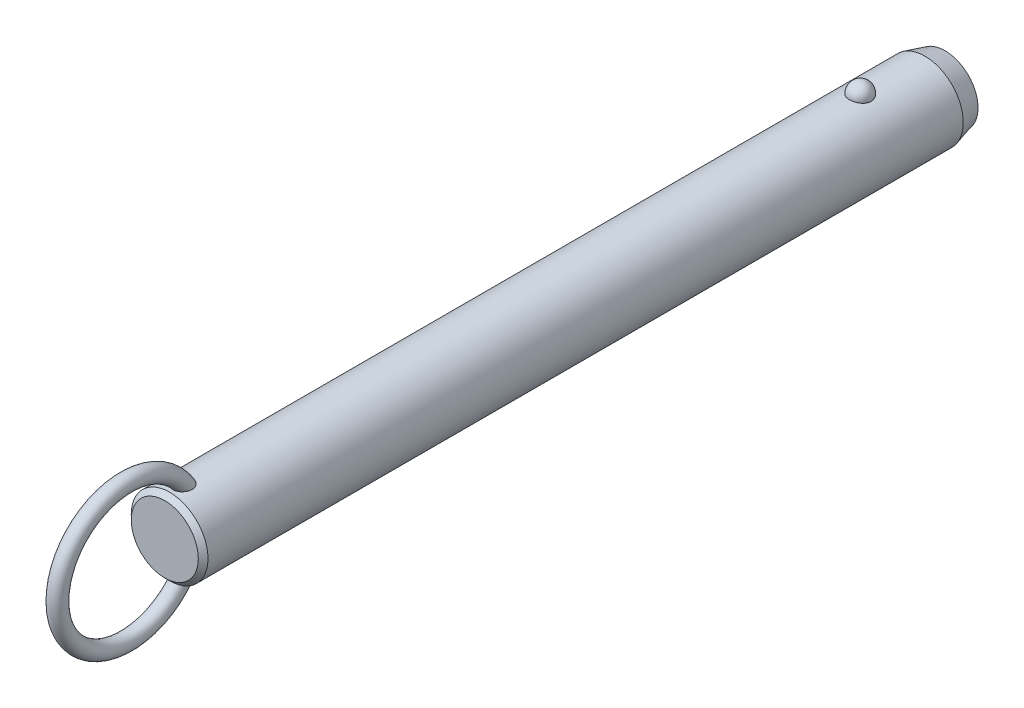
ISO-10303-21;
HEADER;
FILE_DESCRIPTION(('STEP AP214'),'2;1');
FILE_NAME('part.step','',(''),(''),'','','');
FILE_SCHEMA(('AUTOMOTIVE_DESIGN { 1 0 10303 214 1 1 1 1 }'));
ENDSEC;
DATA;
#1=APPLICATION_CONTEXT('core data for automotive mechanical design processes');
#2=APPLICATION_PROTOCOL_DEFINITION('international standard','automotive_design',2000,#1);
#3=PRODUCT_CONTEXT('',#1,'mechanical');
#4=PRODUCT('Part','Part','',(#3));
#5=PRODUCT_RELATED_PRODUCT_CATEGORY('part','',(#4));
#6=PRODUCT_DEFINITION_FORMATION('','',#4);
#7=PRODUCT_DEFINITION_CONTEXT('part definition',#1,'design');
#8=PRODUCT_DEFINITION('design','',#6,#7);
#9=PRODUCT_DEFINITION_SHAPE('','',#8);
#10=(LENGTH_UNIT() NAMED_UNIT(*) SI_UNIT(.MILLI.,.METRE.));
#11=(NAMED_UNIT(*) PLANE_ANGLE_UNIT() SI_UNIT($,.RADIAN.));
#12=(NAMED_UNIT(*) SI_UNIT($,.STERADIAN.) SOLID_ANGLE_UNIT());
#13=UNCERTAINTY_MEASURE_WITH_UNIT(LENGTH_MEASURE(1.E-05),#10,'distance_accuracy_value','');
#14=(GEOMETRIC_REPRESENTATION_CONTEXT(3) GLOBAL_UNCERTAINTY_ASSIGNED_CONTEXT((#13)) GLOBAL_UNIT_ASSIGNED_CONTEXT((#10,
#11,#12)) REPRESENTATION_CONTEXT('',''));
#15=CARTESIAN_POINT('',(0.,0.,0.));
#16=DIRECTION('',(0.,0.,1.));
#17=DIRECTION('',(1.,0.,0.));
#18=AXIS2_PLACEMENT_3D('',#15,#16,#17);
#19=CARTESIAN_POINT('',(0.,0.,160.));
#20=DIRECTION('',(0.,0.,-1.));
#21=DIRECTION('',(-1.,0.,0.));
#22=AXIS2_PLACEMENT_3D('',#19,#20,#21);
#23=CYLINDRICAL_SURFACE('',#22,9.5);
#24=CARTESIAN_POINT('',(2.67259918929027,9.11631578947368,-2.70000000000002));
#25=CARTESIAN_POINT('',(2.6725968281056,9.11631786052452,-2.54909854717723));
#26=CARTESIAN_POINT('',(2.66030567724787,9.11994722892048,-2.39816735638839));
#27=CARTESIAN_POINT('',(2.6114347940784,9.13405924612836,-2.10058568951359));
#28=CARTESIAN_POINT('',(2.57484658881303,9.14454428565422,-1.95393672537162));
#29=CARTESIAN_POINT('',(2.47830875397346,9.17117631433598,-1.66916069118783));
#30=CARTESIAN_POINT('',(2.41836936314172,9.18732082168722,-1.53102991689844));
#31=CARTESIAN_POINT('',(2.27661331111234,9.22346780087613,-1.26705393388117));
#32=CARTESIAN_POINT('',(2.19479699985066,9.24347021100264,-1.14120852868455));
#33=CARTESIAN_POINT('',(2.01085282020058,9.28522401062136,-0.904632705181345));
#34=CARTESIAN_POINT('',(1.90862396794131,9.30698376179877,-0.793982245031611));
#35=CARTESIAN_POINT('',(1.6867437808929,9.34973971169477,-0.59160721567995));
#36=CARTESIAN_POINT('',(1.56709244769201,9.37073591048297,-0.499882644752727));
#37=CARTESIAN_POINT('',(1.31393976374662,9.40956370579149,-0.338167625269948));
#38=CARTESIAN_POINT('',(1.18048026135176,9.42740444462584,-0.268113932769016));
#39=CARTESIAN_POINT('',(0.903154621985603,9.45799906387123,-0.151390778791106));
#40=CARTESIAN_POINT('',(0.759289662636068,9.47075351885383,-0.104718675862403));
#41=CARTESIAN_POINT('',(0.468074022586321,9.48956256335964,-0.0367633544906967));
#42=CARTESIAN_POINT('',(0.320836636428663,9.49573643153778,-0.0150275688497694));
#43=CARTESIAN_POINT('',(0.0246714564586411,9.50112183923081,0.00396199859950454));
#44=CARTESIAN_POINT('',(-0.124256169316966,9.50033406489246,0.00121819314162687));
#45=CARTESIAN_POINT('',(-0.417264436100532,9.4919475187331,-0.0284441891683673));
#46=CARTESIAN_POINT('',(-0.56138413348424,9.48444885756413,-0.0550074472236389));
#47=CARTESIAN_POINT('',(-0.842986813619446,9.46357853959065,-0.131064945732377));
#48=CARTESIAN_POINT('',(-0.980469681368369,9.450206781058,-0.180559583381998));
#49=CARTESIAN_POINT('',(-1.24585005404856,9.41890822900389,-0.301476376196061));
#50=CARTESIAN_POINT('',(-1.37368611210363,9.40095498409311,-0.373026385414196));
#51=CARTESIAN_POINT('',(-1.61552738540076,9.36242964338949,-0.536025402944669));
#52=CARTESIAN_POINT('',(-1.72953116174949,9.34185727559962,-0.627476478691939));
#53=CARTESIAN_POINT('',(-1.9429225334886,9.29984568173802,-0.829844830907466));
#54=CARTESIAN_POINT('',(-2.04198021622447,9.27839736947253,-0.941108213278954));
#55=CARTESIAN_POINT('',(-2.22026460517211,9.23735994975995,-1.17883414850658));
#56=CARTESIAN_POINT('',(-2.29948985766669,9.21777097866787,-1.30529781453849));
#57=CARTESIAN_POINT('',(-2.43697287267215,9.18238994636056,-1.57158566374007));
#58=CARTESIAN_POINT('',(-2.49497068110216,9.16664569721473,-1.71155057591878));
#59=CARTESIAN_POINT('',(-2.5872073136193,9.14104303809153,-1.99961197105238));
#60=CARTESIAN_POINT('',(-2.62144683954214,9.13118445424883,-2.1477082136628));
#61=CARTESIAN_POINT('',(-2.66521466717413,9.11850622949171,-2.44715424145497));
#62=CARTESIAN_POINT('',(-2.67484831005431,9.11565658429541,-2.59848735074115));
#63=CARTESIAN_POINT('',(-2.66946735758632,9.11723375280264,-2.90067317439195));
#64=CARTESIAN_POINT('',(-2.65445345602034,9.12166036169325,-3.05152590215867));
#65=CARTESIAN_POINT('',(-2.60029711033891,9.13724422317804,-3.34766110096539));
#66=CARTESIAN_POINT('',(-2.56127978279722,9.14836656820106,-3.49296833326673));
#67=CARTESIAN_POINT('',(-2.46018844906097,9.17606676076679,-3.77477535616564));
#68=CARTESIAN_POINT('',(-2.39811349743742,9.1926448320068,-3.91127478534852));
#69=CARTESIAN_POINT('',(-2.25202303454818,9.22952198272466,-4.17244273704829));
#70=CARTESIAN_POINT('',(-2.16788714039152,9.24984129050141,-4.29704106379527));
#71=CARTESIAN_POINT('',(-1.9799408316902,9.29188255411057,-4.53013066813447));
#72=CARTESIAN_POINT('',(-1.87612963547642,9.31360456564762,-4.63862130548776));
#73=CARTESIAN_POINT('',(-1.65105429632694,9.35612959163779,-4.83690299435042));
#74=CARTESIAN_POINT('',(-1.52972405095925,9.37692871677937,-4.9266199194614));
#75=CARTESIAN_POINT('',(-1.27318250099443,9.41518970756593,-5.08429106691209));
#76=CARTESIAN_POINT('',(-1.13797219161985,9.432651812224,-5.15224684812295));
#77=CARTESIAN_POINT('',(-0.859280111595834,9.46208255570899,-5.26371827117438));
#78=CARTESIAN_POINT('',(-0.715925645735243,9.47411833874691,-5.30753421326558));
#79=CARTESIAN_POINT('',(-0.423550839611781,9.4916822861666,-5.37076321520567));
#80=CARTESIAN_POINT('',(-0.2745312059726,9.49721125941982,-5.39017930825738));
#81=CARTESIAN_POINT('',(0.0218446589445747,9.50110860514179,-5.40390587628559));
#82=CARTESIAN_POINT('',(0.16917707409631,9.49961381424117,-5.39869609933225));
#83=CARTESIAN_POINT('',(0.460808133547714,9.48993906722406,-5.36441955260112));
#84=CARTESIAN_POINT('',(0.605106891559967,9.48175936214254,-5.33535367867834));
#85=CARTESIAN_POINT('',(0.886027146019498,9.4596376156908,-5.25435587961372));
#86=CARTESIAN_POINT('',(1.02267710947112,9.44571881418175,-5.20251612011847));
#87=CARTESIAN_POINT('',(1.28523827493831,9.41358993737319,-5.07741549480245));
#88=CARTESIAN_POINT('',(1.41114877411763,9.39537958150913,-5.00415322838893));
#89=CARTESIAN_POINT('',(1.65085227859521,9.3562644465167,-4.83684599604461));
#90=CARTESIAN_POINT('',(1.76442346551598,9.33532178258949,-4.74249218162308));
#91=CARTESIAN_POINT('',(1.97425672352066,9.29321198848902,-4.53620389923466));
#92=CARTESIAN_POINT('',(2.07051582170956,9.27204482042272,-4.42426641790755));
#93=CARTESIAN_POINT('',(2.24490086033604,9.23139221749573,-4.18363183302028));
#94=CARTESIAN_POINT('',(2.32267019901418,9.21194380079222,-4.05466990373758));
#95=CARTESIAN_POINT('',(2.45584092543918,9.1773419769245,-3.78517836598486));
#96=CARTESIAN_POINT('',(2.5112497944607,9.16218713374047,-3.644652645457));
#97=CARTESIAN_POINT('',(2.59380876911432,9.13913522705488,-3.37104301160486));
#98=CARTESIAN_POINT('',(2.62330266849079,9.13064624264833,-3.23871053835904));
#99=CARTESIAN_POINT('',(2.66269870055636,9.11923566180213,-2.97092664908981));
#100=CARTESIAN_POINT('',(2.67260130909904,9.11631393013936,-2.83547530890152));
#101=CARTESIAN_POINT('',(2.67259918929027,9.11631578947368,-2.70000000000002));
#102=B_SPLINE_CURVE_WITH_KNOTS('',3,(#24,#25,#26,#27,#28,#29,#30,#31,#32,#33,#34,#35,#36,#37,
#38,#39,#40,#41,#42,#43,#44,#45,#46,#47,#48,#49,#50,#51,#52,#53,#54,#55,#56,#57,#58,#59,#60,#61,
#62,#63,#64,#65,#66,#67,#68,#69,#70,#71,#72,#73,#74,#75,#76,#77,#78,#79,#80,#81,#82,#83,#84,#85,
#86,#87,#88,#89,#90,#91,#92,#93,#94,#95,#96,#97,#98,#99,#100,#101),.UNSPECIFIED.,.T.,.F.,(4,2,2,
2,2,2,2,2,2,2,2,2,2,2,2,2,2,2,2,2,2,2,2,2,2,2,2,2,2,2,2,2,2,2,2,2,2,2,4),(0.,0.452217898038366,
0.904593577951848,1.35677112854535,1.80894144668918,2.26340676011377,2.71787203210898,
3.17099820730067,3.62407318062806,4.0687883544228,4.51345969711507,4.95160616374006,
5.38976021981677,5.83050358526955,6.27129275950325,6.72071308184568,7.17016633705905,
7.62495278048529,8.07972578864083,8.53254856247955,8.98535859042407,9.43582813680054,
9.88631615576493,10.3393155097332,10.7923328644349,11.2471065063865,11.7018475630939,
12.150795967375,12.599688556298,13.0398725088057,13.4800399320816,13.9184421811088,
14.3568730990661,14.802202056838,15.2476074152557,15.7010097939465,16.1542603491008,
16.5602594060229,16.966248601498),.UNSPECIFIED.);
#103=CARTESIAN_POINT('',(2.67259918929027,9.11631578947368,-2.70000000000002));
#104=VERTEX_POINT('',#103);
#105=EDGE_CURVE('E41',#104,#104,#102,.T.);
#106=ORIENTED_EDGE('',*,*,#105,.T.);
#107=EDGE_LOOP('',(#106));
#108=FACE_BOUND('',#107,.T.);
#109=CARTESIAN_POINT('',(0.,0.,168.32));
#110=DIRECTION('',(0.,0.,1.));
#111=DIRECTION('',(1.,0.,0.));
#112=AXIS2_PLACEMENT_3D('',#109,#110,#111);
#113=CIRCLE('',#112,9.5);
#114=CARTESIAN_POINT('',(9.5,0.,168.32));
#115=VERTEX_POINT('',#114);
#116=EDGE_CURVE('E10',#115,#115,#113,.F.);
#117=ORIENTED_EDGE('',*,*,#116,.T.);
#118=EDGE_LOOP('',(#117));
#119=FACE_BOUND('',#118,.T.);
#120=CARTESIAN_POINT('',(-0.697062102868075,-9.47439269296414,162.667808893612));
#121=CARTESIAN_POINT('',(-0.799579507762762,-9.46685146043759,162.707482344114));
#122=CARTESIAN_POINT('',(-0.89857563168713,-9.45788043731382,162.7559309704));
#123=CARTESIAN_POINT('',(-1.08670047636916,-9.43811593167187,162.868868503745));
#124=CARTESIAN_POINT('',(-1.17583204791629,-9.42732297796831,162.933352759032));
#125=CARTESIAN_POINT('',(-1.34179806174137,-9.40513672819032,163.076209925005));
#126=CARTESIAN_POINT('',(-1.41865133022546,-9.39374438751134,163.154561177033));
#127=CARTESIAN_POINT('',(-1.5586004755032,-9.37154196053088,163.322752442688));
#128=CARTESIAN_POINT('',(-1.62169476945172,-9.3607319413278,163.41259377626));
#129=CARTESIAN_POINT('',(-1.73527695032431,-9.34035749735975,163.604500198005));
#130=CARTESIAN_POINT('',(-1.78522266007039,-9.33085270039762,163.706891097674));
#131=CARTESIAN_POINT('',(-1.86924997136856,-9.3143834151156,163.918148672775));
#132=CARTESIAN_POINT('',(-1.90332570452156,-9.30741986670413,164.027017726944));
#133=CARTESIAN_POINT('',(-1.95893603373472,-9.29588482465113,164.260473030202));
#134=CARTESIAN_POINT('',(-1.97872420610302,-9.29165182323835,164.385489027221));
#135=CARTESIAN_POINT('',(-2.00062129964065,-9.28695978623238,164.637080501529));
#136=CARTESIAN_POINT('',(-2.00272284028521,-9.28650232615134,164.763656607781));
#137=CARTESIAN_POINT('',(-1.98958876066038,-9.28932750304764,165.036815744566));
#138=CARTESIAN_POINT('',(-1.97143366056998,-9.2932400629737,165.183251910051));
#139=CARTESIAN_POINT('',(-1.91479925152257,-9.30507151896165,165.472062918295));
#140=CARTESIAN_POINT('',(-1.87629122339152,-9.31299607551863,165.614431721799));
#141=CARTESIAN_POINT('',(-1.7722568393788,-9.33340232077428,165.915172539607));
#142=CARTESIAN_POINT('',(-1.70334898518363,-9.34641636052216,166.072369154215));
#143=CARTESIAN_POINT('',(-1.58111062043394,-9.36759153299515,166.297517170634));
#144=CARTESIAN_POINT('',(-1.5372145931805,-9.37492619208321,166.370796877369));
#145=CARTESIAN_POINT('',(-1.44302631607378,-9.38988566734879,166.51307405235));
#146=CARTESIAN_POINT('',(-1.39273721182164,-9.39751033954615,166.582073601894));
#147=CARTESIAN_POINT('',(-1.26775962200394,-9.41530678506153,166.736983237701));
#148=CARTESIAN_POINT('',(-1.19052326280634,-9.42548108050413,166.820871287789));
#149=CARTESIAN_POINT('',(-1.0242024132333,-9.44499825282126,166.976008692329));
#150=CARTESIAN_POINT('',(-0.935139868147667,-9.45434261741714,167.047280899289));
#151=CARTESIAN_POINT('',(-0.766610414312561,-9.46930670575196,167.158695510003));
#152=CARTESIAN_POINT('',(-0.689439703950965,-9.47529223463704,167.202235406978));
#153=CARTESIAN_POINT('',(-0.52894200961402,-9.48560294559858,167.27631336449));
#154=CARTESIAN_POINT('',(-0.445620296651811,-9.48992953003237,167.306862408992));
#155=CARTESIAN_POINT('',(-0.273901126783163,-9.49644161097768,167.352579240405));
#156=CARTESIAN_POINT('',(-0.18546574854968,-9.49860811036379,167.36761059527));
#157=CARTESIAN_POINT('',(-0.00734541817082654,-9.5004135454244,167.380149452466));
#158=CARTESIAN_POINT('',(0.082338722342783,-9.50005405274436,167.377667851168));
#159=CARTESIAN_POINT('',(0.247679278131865,-9.49708301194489,167.356995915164));
#160=CARTESIAN_POINT('',(0.323620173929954,-9.49477609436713,167.340930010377));
#161=CARTESIAN_POINT('',(0.471981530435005,-9.48855917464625,167.297172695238));
#162=CARTESIAN_POINT('',(0.544400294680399,-9.48464840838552,167.269475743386));
#163=CARTESIAN_POINT('',(0.708947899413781,-9.47398336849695,167.19280266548));
#164=CARTESIAN_POINT('',(0.799149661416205,-9.46671310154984,167.139774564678));
#165=CARTESIAN_POINT('',(0.969783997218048,-9.45076225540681,167.019973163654));
#166=CARTESIAN_POINT('',(1.05019415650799,-9.44207854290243,166.953169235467));
#167=CARTESIAN_POINT('',(1.23092343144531,-9.42051459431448,166.780759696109));
#168=CARTESIAN_POINT('',(1.32652499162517,-9.40733378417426,166.67026193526));
#169=CARTESIAN_POINT('',(1.49893121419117,-9.38140745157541,166.435561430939));
#170=CARTESIAN_POINT('',(1.57571616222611,-9.36866239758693,166.311344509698));
#171=CARTESIAN_POINT('',(1.71285426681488,-9.34457644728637,166.049389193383));
#172=CARTESIAN_POINT('',(1.77266365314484,-9.33328726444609,165.91136233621));
#173=CARTESIAN_POINT('',(1.87239208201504,-9.31379209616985,165.628051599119));
#174=CARTESIAN_POINT('',(1.91230158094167,-9.30558759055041,165.482764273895));
#175=CARTESIAN_POINT('',(1.97604189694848,-9.29228394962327,165.162028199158));
#176=CARTESIAN_POINT('',(1.9958743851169,-9.28797202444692,164.985724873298));
#177=CARTESIAN_POINT('',(2.00295708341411,-9.28645519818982,164.632414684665));
#178=CARTESIAN_POINT('',(1.99025930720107,-9.28923895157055,164.455409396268));
#179=CARTESIAN_POINT('',(1.93735479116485,-9.30038134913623,164.156338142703));
#180=CARTESIAN_POINT('',(1.90576827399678,-9.30697680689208,164.032667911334));
#181=CARTESIAN_POINT('',(1.82287484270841,-9.32356855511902,163.792329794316));
#182=CARTESIAN_POINT('',(1.77158213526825,-9.33356239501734,163.675656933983));
#183=CARTESIAN_POINT('',(1.64885744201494,-9.35602275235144,163.452706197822));
#184=CARTESIAN_POINT('',(1.57730995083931,-9.36850332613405,163.346492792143));
#185=CARTESIAN_POINT('',(1.41543264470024,-9.39431873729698,163.149553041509));
#186=CARTESIAN_POINT('',(1.32510883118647,-9.40765330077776,163.058821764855));
#187=CARTESIAN_POINT('',(1.13846223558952,-9.43195720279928,162.905033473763));
#188=CARTESIAN_POINT('',(1.04369890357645,-9.44302894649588,162.840094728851));
#189=CARTESIAN_POINT('',(0.843965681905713,-9.46296805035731,162.728038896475));
#190=CARTESIAN_POINT('',(0.739000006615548,-9.47183631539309,162.680914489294));
#191=CARTESIAN_POINT('',(0.528175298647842,-9.48586140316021,162.608117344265));
#192=CARTESIAN_POINT('',(0.422686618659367,-9.49119633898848,162.58140249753));
#193=CARTESIAN_POINT('',(0.208590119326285,-9.49831365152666,162.546013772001));
#194=CARTESIAN_POINT('',(0.0999817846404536,-9.500095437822,162.537342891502));
#195=CARTESIAN_POINT('',(-0.126104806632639,-9.49988861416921,162.538350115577));
#196=CARTESIAN_POINT('',(-0.243578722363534,-9.49757821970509,162.549594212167));
#197=CARTESIAN_POINT('',(-0.474390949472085,-9.48885165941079,162.593167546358));
#198=CARTESIAN_POINT('',(-0.587729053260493,-9.48243528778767,162.625497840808));
#199=CARTESIAN_POINT('',(-0.697062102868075,-9.47439269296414,162.667808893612));
#200=B_SPLINE_CURVE_WITH_KNOTS('',3,(#120,#121,#122,#123,#124,#125,#126,#127,#128,#129,#130,
#131,#132,#133,#134,#135,#136,#137,#138,#139,#140,#141,#142,#143,#144,#145,#146,#147,#148,#149,
#150,#151,#152,#153,#154,#155,#156,#157,#158,#159,#160,#161,#162,#163,#164,#165,#166,#167,#168,
#169,#170,#171,#172,#173,#174,#175,#176,#177,#178,#179,#180,#181,#182,#183,#184,#185,#186,#187,
#188,#189,#190,#191,#192,#193,#194,#195,#196,#197,#198,#199),.UNSPECIFIED.,.T.,.F.,(4,2,2,2,2,2,
2,2,2,2,2,2,2,2,2,2,2,2,2,2,2,2,2,2,2,2,2,2,2,2,2,2,2,2,2,2,2,2,2,4),(0.,0.330119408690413,
0.6601431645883,0.98965593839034,1.31920659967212,1.66074728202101,2.00241415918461,
2.38088696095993,2.75951768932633,3.20065679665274,3.64242004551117,4.15620996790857,
4.41314162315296,4.66994734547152,5.01228664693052,5.35399933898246,5.61943037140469,
5.88463652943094,6.15215502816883,6.41950709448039,6.65144391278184,6.88349136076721,
7.19641200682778,7.51003602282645,7.94779711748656,8.3860149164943,8.83699707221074,
9.28819530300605,9.81778662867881,10.34653170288,10.7284172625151,11.1100280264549,
11.4938603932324,11.8775702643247,12.2220189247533,12.5663259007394,12.8915939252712,
13.2169159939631,13.5689650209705,13.9210316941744),.UNSPECIFIED.);
#201=CARTESIAN_POINT('',(-0.697062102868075,-9.47439269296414,162.667808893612));
#202=VERTEX_POINT('',#201);
#203=EDGE_CURVE('E60',#202,#202,#200,.T.);
#204=ORIENTED_EDGE('',*,*,#203,.T.);
#205=EDGE_LOOP('',(#204));
#206=FACE_BOUND('',#205,.T.);
#207=CARTESIAN_POINT('',(-0.697062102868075,9.47439269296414,162.667808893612));
#208=CARTESIAN_POINT('',(-0.597792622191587,9.48169483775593,162.62939564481));
#209=CARTESIAN_POINT('',(-0.495106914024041,9.48766580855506,162.599168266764));
#210=CARTESIAN_POINT('',(-0.285876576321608,9.49627648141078,162.556032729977));
#211=CARTESIAN_POINT('',(-0.179324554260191,9.49890941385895,162.543159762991));
#212=CARTESIAN_POINT('',(0.0344157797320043,9.50053798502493,162.535166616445));
#213=CARTESIAN_POINT('',(0.14160360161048,9.49953613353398,162.540034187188));
#214=CARTESIAN_POINT('',(0.353563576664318,9.49401038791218,162.567365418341));
#215=CARTESIAN_POINT('',(0.458336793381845,9.48948807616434,162.58982117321));
#216=CARTESIAN_POINT('',(0.662493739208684,9.4774236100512,162.651671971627));
#217=CARTESIAN_POINT('',(0.761881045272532,9.46988348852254,162.691055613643));
#218=CARTESIAN_POINT('',(0.952608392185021,9.45260382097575,162.785634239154));
#219=CARTESIAN_POINT('',(1.04394806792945,9.44286417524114,162.840829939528));
#220=CARTESIAN_POINT('',(1.21712767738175,9.42211760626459,162.966066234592));
#221=CARTESIAN_POINT('',(1.29885671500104,9.41109835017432,163.036257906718));
#222=CARTESIAN_POINT('',(1.44978975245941,9.38903310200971,163.188980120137));
#223=CARTESIAN_POINT('',(1.51899278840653,9.37798710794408,163.271511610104));
#224=CARTESIAN_POINT('',(1.64602857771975,9.35654375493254,163.449776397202));
#225=CARTESIAN_POINT('',(1.70333052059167,9.34618688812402,163.545891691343));
#226=CARTESIAN_POINT('',(1.80259341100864,9.32755128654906,163.745897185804));
#227=CARTESIAN_POINT('',(1.84454942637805,9.31927322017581,163.849789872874));
#228=CARTESIAN_POINT('',(1.91637039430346,9.30478365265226,164.072213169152));
#229=CARTESIAN_POINT('',(1.944805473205,9.29882552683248,164.191219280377));
#230=CARTESIAN_POINT('',(1.98449865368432,9.29043398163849,164.432143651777));
#231=CARTESIAN_POINT('',(1.99574908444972,9.28800213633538,164.554063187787));
#232=CARTESIAN_POINT('',(2.00275141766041,9.28649645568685,164.816932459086));
#233=CARTESIAN_POINT('',(1.99588238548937,9.28799035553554,164.957952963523));
#234=CARTESIAN_POINT('',(1.96270559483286,9.29505517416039,165.237621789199));
#235=CARTESIAN_POINT('',(1.93637872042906,9.30063010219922,165.376267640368));
#236=CARTESIAN_POINT('',(1.85949176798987,9.31633564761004,165.672561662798));
#237=CARTESIAN_POINT('',(1.80549792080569,9.3270926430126,165.829290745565));
#238=CARTESIAN_POINT('',(1.67376869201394,9.3516306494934,166.132284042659));
#239=CARTESIAN_POINT('',(1.59603181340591,9.36541185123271,166.278547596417));
#240=CARTESIAN_POINT('',(1.4360277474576,9.39110706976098,166.525813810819));
#241=CARTESIAN_POINT('',(1.35831795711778,9.40278656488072,166.629791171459));
#242=CARTESIAN_POINT('',(1.18774483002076,9.42585025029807,166.824534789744));
#243=CARTESIAN_POINT('',(1.09490932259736,9.43723493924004,166.915324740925));
#244=CARTESIAN_POINT('',(0.921110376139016,9.45552616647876,167.05620334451));
#245=CARTESIAN_POINT('',(0.843738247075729,9.46281058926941,167.110656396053));
#246=CARTESIAN_POINT('',(0.681245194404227,9.47589120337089,167.206711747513));
#247=CARTESIAN_POINT('',(0.596135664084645,9.48168953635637,167.248332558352));
#248=CARTESIAN_POINT('',(0.433779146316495,9.49038144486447,167.310089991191));
#249=CARTESIAN_POINT('',(0.35745955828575,9.49359170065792,167.33260136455));
#250=CARTESIAN_POINT('',(0.202074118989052,9.49816761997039,167.364574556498));
#251=CARTESIAN_POINT('',(0.123010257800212,9.49953459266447,167.374045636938));
#252=CARTESIAN_POINT('',(-0.0357372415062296,9.50026497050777,167.379114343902));
#253=CARTESIAN_POINT('',(-0.115421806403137,9.49962433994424,167.374684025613));
#254=CARTESIAN_POINT('',(-0.272823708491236,9.49640854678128,167.352296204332));
#255=CARTESIAN_POINT('',(-0.350540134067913,9.4938325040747,167.334332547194));
#256=CARTESIAN_POINT('',(-0.500580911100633,9.48709462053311,167.286802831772));
#257=CARTESIAN_POINT('',(-0.572979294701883,9.48296359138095,167.257461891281));
#258=CARTESIAN_POINT('',(-0.712864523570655,9.47347609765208,167.189008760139));
#259=CARTESIAN_POINT('',(-0.780349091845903,9.46811906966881,167.149892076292));
#260=CARTESIAN_POINT('',(-0.946309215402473,9.45329720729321,167.039432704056));
#261=CARTESIAN_POINT('',(-1.04090230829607,9.44321512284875,166.962329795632));
#262=CARTESIAN_POINT('',(-1.21661929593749,9.42219227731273,166.79409718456));
#263=CARTESIAN_POINT('',(-1.29770519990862,9.41124921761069,166.702929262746));
#264=CARTESIAN_POINT('',(-1.47319646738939,9.38563439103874,166.476162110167));
#265=CARTESIAN_POINT('',(-1.5620887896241,9.37102009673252,166.336289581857));
#266=CARTESIAN_POINT('',(-1.71623987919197,9.34401559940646,166.043950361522));
#267=CARTESIAN_POINT('',(-1.7814786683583,9.33162728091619,165.891473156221));
#268=CARTESIAN_POINT('',(-1.88853837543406,9.31055541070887,165.575647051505));
#269=CARTESIAN_POINT('',(-1.92998995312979,9.30193076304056,165.412168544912));
#270=CARTESIAN_POINT('',(-1.98590726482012,9.29015757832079,165.080526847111));
#271=CARTESIAN_POINT('',(-2.0004070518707,9.2870021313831,164.912369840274));
#272=CARTESIAN_POINT('',(-1.99964701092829,9.28716218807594,164.605080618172));
#273=CARTESIAN_POINT('',(-1.98908145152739,9.28945704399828,164.465936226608));
#274=CARTESIAN_POINT('',(-1.94566294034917,9.29865169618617,164.191153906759));
#275=CARTESIAN_POINT('',(-1.91282062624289,9.30554929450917,164.055514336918));
#276=CARTESIAN_POINT('',(-1.84582133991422,9.31898248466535,163.857802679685));
#277=CARTESIAN_POINT('',(-1.82038084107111,9.32400364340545,163.792583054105));
#278=CARTESIAN_POINT('',(-1.7635051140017,9.33492884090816,163.664903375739));
#279=CARTESIAN_POINT('',(-1.73207305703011,9.34083241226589,163.602441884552));
#280=CARTESIAN_POINT('',(-1.66324243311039,9.35333332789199,163.48094078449));
#281=CARTESIAN_POINT('',(-1.625842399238,9.35993084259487,163.421902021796));
#282=CARTESIAN_POINT('',(-1.54527678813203,9.37356864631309,163.307987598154));
#283=CARTESIAN_POINT('',(-1.50211241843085,9.38060884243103,163.253111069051));
#284=CARTESIAN_POINT('',(-1.37681147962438,9.40004442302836,163.109961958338));
#285=CARTESIAN_POINT('',(-1.28916358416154,9.41261047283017,163.026429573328));
#286=CARTESIAN_POINT('',(-1.09996826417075,9.43658180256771,162.877236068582));
#287=CARTESIAN_POINT('',(-0.998461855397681,9.44799034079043,162.811523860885));
#288=CARTESIAN_POINT('',(-0.860188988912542,9.46103017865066,162.7394367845));
#289=CARTESIAN_POINT('',(-0.828141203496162,9.46389141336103,162.723851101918));
#290=CARTESIAN_POINT('',(-0.763210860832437,9.46934915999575,162.694473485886));
#291=CARTESIAN_POINT('',(-0.730328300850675,9.47194567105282,162.680681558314));
#292=CARTESIAN_POINT('',(-0.697062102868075,9.47439269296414,162.667808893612));
#293=B_SPLINE_CURVE_WITH_KNOTS('',3,(#207,#208,#209,#210,#211,#212,#213,#214,#215,#216,#217,
#218,#219,#220,#221,#222,#223,#224,#225,#226,#227,#228,#229,#230,#231,#232,#233,#234,#235,#236,
#237,#238,#239,#240,#241,#242,#243,#244,#245,#246,#247,#248,#249,#250,#251,#252,#253,#254,#255,
#256,#257,#258,#259,#260,#261,#262,#263,#264,#265,#266,#267,#268,#269,#270,#271,#272,#273,#274,
#275,#276,#277,#278,#279,#280,#281,#282,#283,#284,#285,#286,#287,#288,#289,#290,#291,#292),
.UNSPECIFIED.,.T.,.F.,(4,2,2,2,2,2,2,2,2,2,2,2,2,2,2,2,2,2,2,2,2,2,2,2,2,2,2,2,2,2,2,2,2,2,2,2,
2,2,2,2,2,2,4),(0.,0.319942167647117,0.640532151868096,0.960900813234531,1.28112555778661,
1.60113495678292,1.92115886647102,2.24457323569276,2.56801248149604,2.90371927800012,
3.23953387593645,3.60560313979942,3.97183576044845,4.39383693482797,4.81625324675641,
5.31257045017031,5.80891895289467,6.19868344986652,6.58773876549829,6.87145417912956,
7.15475838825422,7.3926375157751,7.63034760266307,7.86853584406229,8.10683246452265,
8.34063661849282,8.57454843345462,8.93983939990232,9.30614105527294,9.80266668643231,
10.2996107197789,10.8040753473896,11.3079021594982,11.7249776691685,12.1418541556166,
12.3521485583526,12.5623319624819,12.7725671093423,12.9827582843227,13.345827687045,
13.7078449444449,13.8150604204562,13.9222762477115),.UNSPECIFIED.);
#294=CARTESIAN_POINT('',(-0.697062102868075,9.47439269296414,162.667808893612));
#295=VERTEX_POINT('',#294);
#296=EDGE_CURVE('E67',#295,#295,#293,.T.);
#297=ORIENTED_EDGE('',*,*,#296,.T.);
#298=EDGE_LOOP('',(#297));
#299=FACE_BOUND('',#298,.T.);
#300=CARTESIAN_POINT('',(0.,0.,-18.6999999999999));
#301=DIRECTION('',(0.,0.,-1.));
#302=DIRECTION('',(-1.,0.,0.));
#303=AXIS2_PLACEMENT_3D('',#300,#301,#302);
#304=CIRCLE('',#303,9.5);
#305=CARTESIAN_POINT('',(-9.5,0.,-18.6999999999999));
#306=VERTEX_POINT('',#305);
#307=EDGE_CURVE('E57',#306,#306,#304,.F.);
#308=ORIENTED_EDGE('',*,*,#307,.T.);
#309=EDGE_LOOP('',(#308));
#310=FACE_BOUND('',#309,.T.);
#311=ADVANCED_FACE('F37',(#108,#119,#206,#299,#310),#23,.T.);
#312=CARTESIAN_POINT('',(0.,0.,-23.7));
#313=DIRECTION('',(0.,0.,-1.));
#314=DIRECTION('',(-1.,0.,0.));
#315=AXIS2_PLACEMENT_3D('',#312,#313,#314);
#316=PLANE('',#315);
#317=CARTESIAN_POINT('',(0.,0.,-23.7));
#318=DIRECTION('',(0.,0.,-1.));
#319=DIRECTION('',(-1.,0.,0.));
#320=AXIS2_PLACEMENT_3D('',#317,#318,#319);
#321=CIRCLE('',#320,8.16025403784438);
#322=CARTESIAN_POINT('',(-8.16025403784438,0.,-23.7));
#323=VERTEX_POINT('',#322);
#324=EDGE_CURVE('E66',#323,#323,#321,.T.);
#325=ORIENTED_EDGE('',*,*,#324,.T.);
#326=EDGE_LOOP('',(#325));
#327=FACE_BOUND('',#326,.T.);
#328=ADVANCED_FACE('F85',(#327),#316,.T.);
#329=CARTESIAN_POINT('',(0.,0.,-23.7));
#330=DIRECTION('',(0.,0.,1.));
#331=DIRECTION('',(1.,0.,0.));
#332=AXIS2_PLACEMENT_3D('',#329,#330,#331);
#333=CONICAL_SURFACE('',#332,8.16025403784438,0.261799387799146);
#334=ORIENTED_EDGE('',*,*,#307,.F.);
#335=EDGE_LOOP('',(#334));
#336=FACE_BOUND('',#335,.T.);
#337=ORIENTED_EDGE('',*,*,#324,.F.);
#338=EDGE_LOOP('',(#337));
#339=FACE_BOUND('',#338,.T.);
#340=ADVANCED_FACE('F83',(#336,#339),#333,.T.);
#341=CARTESIAN_POINT('',(0.,0.,169.52));
#342=DIRECTION('',(0.,0.,1.));
#343=DIRECTION('',(1.,0.,0.));
#344=AXIS2_PLACEMENT_3D('',#341,#342,#343);
#345=PLANE('',#344);
#346=CARTESIAN_POINT('',(0.,0.,169.52));
#347=DIRECTION('',(0.,0.,1.));
#348=DIRECTION('',(1.,0.,0.));
#349=AXIS2_PLACEMENT_3D('',#346,#347,#348);
#350=CIRCLE('',#349,8.3);
#351=CARTESIAN_POINT('',(8.3,0.,169.52));
#352=VERTEX_POINT('',#351);
#353=EDGE_CURVE('E50',#352,#352,#350,.T.);
#354=ORIENTED_EDGE('',*,*,#353,.T.);
#355=EDGE_LOOP('',(#354));
#356=FACE_BOUND('',#355,.T.);
#357=ADVANCED_FACE('F77',(#356),#345,.T.);
#358=CARTESIAN_POINT('',(0.,0.,179.05));
#359=DIRECTION('',(1.,0.,0.));
#360=DIRECTION('',(0.,0.,-1.));
#361=AXIS2_PLACEMENT_3D('',#358,#359,#360);
#362=TOROIDAL_SURFACE('',#361,17.05,2.);
#363=ORIENTED_EDGE('',*,*,#296,.F.);
#364=EDGE_LOOP('',(#363));
#365=FACE_BOUND('',#364,.T.);
#366=ORIENTED_EDGE('',*,*,#203,.F.);
#367=EDGE_LOOP('',(#366));
#368=FACE_BOUND('',#367,.T.);
#369=ADVANCED_FACE('F73',(#365,#368),#362,.T.);
#370=CARTESIAN_POINT('',(0.,0.,169.52));
#371=DIRECTION('',(0.,0.,-1.));
#372=DIRECTION('',(-1.,0.,0.));
#373=AXIS2_PLACEMENT_3D('',#370,#371,#372);
#374=CONICAL_SURFACE('',#373,8.3,0.785398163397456);
#375=ORIENTED_EDGE('',*,*,#116,.F.);
#376=EDGE_LOOP('',(#375));
#377=FACE_BOUND('',#376,.T.);
#378=ORIENTED_EDGE('',*,*,#353,.F.);
#379=EDGE_LOOP('',(#378));
#380=FACE_BOUND('',#379,.T.);
#381=ADVANCED_FACE('F39',(#377,#380),#374,.T.);
#382=CARTESIAN_POINT('',(0.,9.5,-2.70000000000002));
#383=DIRECTION('',(0.,1.,0.));
#384=DIRECTION('',(0.,0.,-1.));
#385=AXIS2_PLACEMENT_3D('',#382,#383,#384);
#386=SPHERICAL_SURFACE('',#385,2.7);
#387=ORIENTED_EDGE('',*,*,#105,.F.);
#388=EDGE_LOOP('',(#387));
#389=FACE_BOUND('',#388,.T.);
#390=ADVANCED_FACE('F79',(#389),#386,.T.);
#391=CLOSED_SHELL('',(#311,#328,#340,#357,#369,#381,#390));
#392=MANIFOLD_SOLID_BREP('B2',#391);
#393=ADVANCED_BREP_SHAPE_REPRESENTATION('',(#18,#392),#14);
#394=SHAPE_DEFINITION_REPRESENTATION(#9,#393);
ENDSEC;
END-ISO-10303-21;
